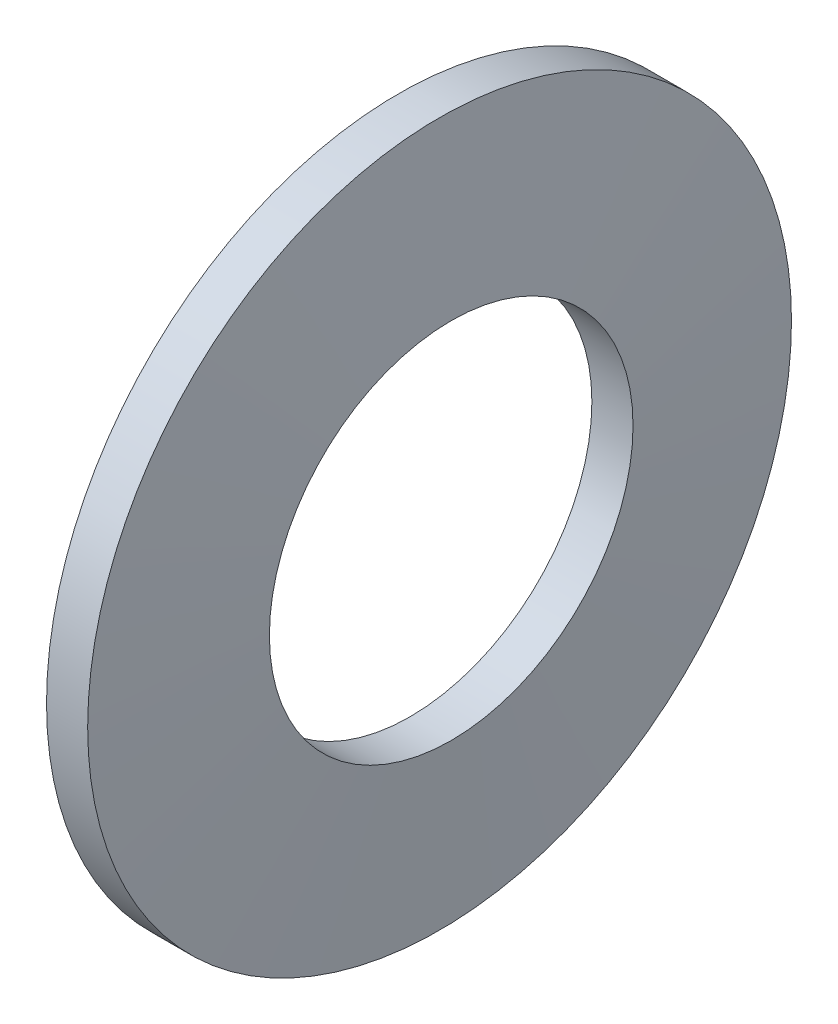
from build123d import *


with BuildPart() as part:
    # Esquisse1 → Base-R_volution (revolve)
    with BuildSketch(Plane.XY, mode=Mode.PRIVATE) as base_r_volution_sk:
        Polygon((0, 30), (3.508178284, 30), (4.5, 15.5), (0.991821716, 15.5), align=None)
    revolve(base_r_volution_sk.sketch.rotate(Axis((0, 0, 0), (1, 0, 0)), 90), axis=Axis((0, 0, 0), (1, 0, 0)))


solid = part.part
